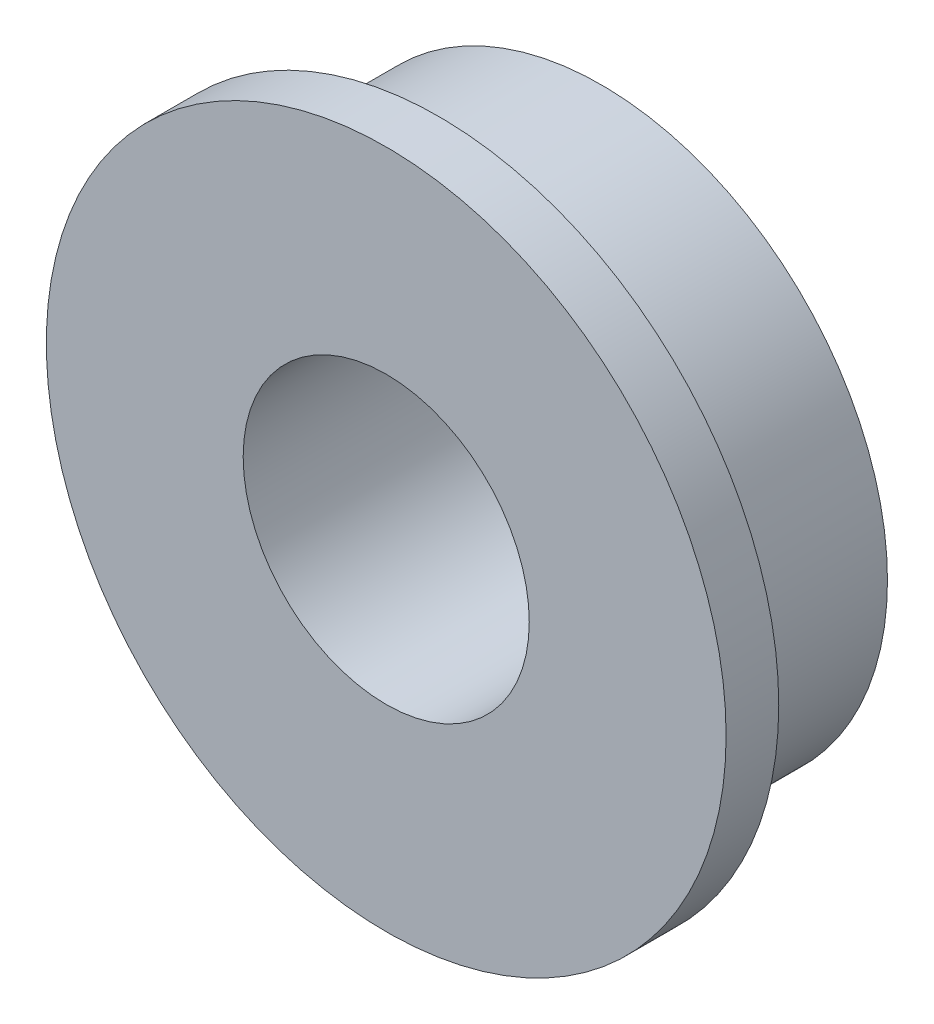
ISO-10303-21;
HEADER;
FILE_DESCRIPTION(('STEP AP214'),'2;1');
FILE_NAME('part.step','',(''),(''),'','','');
FILE_SCHEMA(('AUTOMOTIVE_DESIGN { 1 0 10303 214 1 1 1 1 }'));
ENDSEC;
DATA;
#1=APPLICATION_CONTEXT('core data for automotive mechanical design processes');
#2=APPLICATION_PROTOCOL_DEFINITION('international standard','automotive_design',2000,#1);
#3=PRODUCT_CONTEXT('',#1,'mechanical');
#4=PRODUCT('Part','Part','',(#3));
#5=PRODUCT_RELATED_PRODUCT_CATEGORY('part','',(#4));
#6=PRODUCT_DEFINITION_FORMATION('','',#4);
#7=PRODUCT_DEFINITION_CONTEXT('part definition',#1,'design');
#8=PRODUCT_DEFINITION('design','',#6,#7);
#9=PRODUCT_DEFINITION_SHAPE('','',#8);
#10=(LENGTH_UNIT() NAMED_UNIT(*) SI_UNIT(.MILLI.,.METRE.));
#11=(NAMED_UNIT(*) PLANE_ANGLE_UNIT() SI_UNIT($,.RADIAN.));
#12=(NAMED_UNIT(*) SI_UNIT($,.STERADIAN.) SOLID_ANGLE_UNIT());
#13=UNCERTAINTY_MEASURE_WITH_UNIT(LENGTH_MEASURE(1.E-05),#10,'distance_accuracy_value','');
#14=(GEOMETRIC_REPRESENTATION_CONTEXT(3) GLOBAL_UNCERTAINTY_ASSIGNED_CONTEXT((#13)) GLOBAL_UNIT_ASSIGNED_CONTEXT((#10,
#11,#12)) REPRESENTATION_CONTEXT('',''));
#15=CARTESIAN_POINT('',(0.,0.,0.));
#16=DIRECTION('',(0.,0.,1.));
#17=DIRECTION('',(1.,0.,0.));
#18=AXIS2_PLACEMENT_3D('',#15,#16,#17);
#19=CARTESIAN_POINT('',(0.,0.,2.3876));
#20=DIRECTION('',(0.,0.,-1.));
#21=DIRECTION('',(-1.,0.,0.));
#22=AXIS2_PLACEMENT_3D('',#19,#20,#21);
#23=CYLINDRICAL_SURFACE('',#22,3.175);
#24=CARTESIAN_POINT('',(0.,0.,0.));
#25=DIRECTION('',(0.,0.,1.));
#26=DIRECTION('',(1.,0.,0.));
#27=AXIS2_PLACEMENT_3D('',#24,#25,#26);
#28=CIRCLE('',#27,3.175);
#29=CARTESIAN_POINT('',(3.175,0.,0.));
#30=VERTEX_POINT('',#29);
#31=EDGE_CURVE('E34',#30,#30,#28,.T.);
#32=ORIENTED_EDGE('',*,*,#31,.T.);
#33=EDGE_LOOP('',(#32));
#34=FACE_BOUND('',#33,.T.);
#35=CARTESIAN_POINT('',(0.,0.,1.8034));
#36=DIRECTION('',(0.,0.,1.));
#37=DIRECTION('',(1.,0.,0.));
#38=AXIS2_PLACEMENT_3D('',#35,#36,#37);
#39=CIRCLE('',#38,3.175);
#40=CARTESIAN_POINT('',(3.175,0.,1.8034));
#41=VERTEX_POINT('',#40);
#42=EDGE_CURVE('E10',#41,#41,#39,.T.);
#43=ORIENTED_EDGE('',*,*,#42,.F.);
#44=EDGE_LOOP('',(#43));
#45=FACE_BOUND('',#44,.T.);
#46=ADVANCED_FACE('F28',(#34,#45),#23,.T.);
#47=CARTESIAN_POINT('',(0.,0.,2.3876));
#48=DIRECTION('',(0.,0.,1.));
#49=DIRECTION('',(1.,0.,0.));
#50=AXIS2_PLACEMENT_3D('',#47,#48,#49);
#51=PLANE('',#50);
#52=CARTESIAN_POINT('',(0.,0.,2.3876));
#53=DIRECTION('',(0.,0.,1.));
#54=DIRECTION('',(1.,0.,0.));
#55=AXIS2_PLACEMENT_3D('',#52,#53,#54);
#56=CIRCLE('',#55,1.5875);
#57=CARTESIAN_POINT('',(1.5875,0.,2.3876));
#58=VERTEX_POINT('',#57);
#59=EDGE_CURVE('E38',#58,#58,#56,.T.);
#60=ORIENTED_EDGE('',*,*,#59,.F.);
#61=EDGE_LOOP('',(#60));
#62=FACE_BOUND('',#61,.T.);
#63=CARTESIAN_POINT('',(0.,0.,2.3876));
#64=DIRECTION('',(0.,0.,1.));
#65=DIRECTION('',(1.,0.,0.));
#66=AXIS2_PLACEMENT_3D('',#63,#64,#65);
#67=CIRCLE('',#66,3.7719);
#68=CARTESIAN_POINT('',(3.7719,0.,2.3876));
#69=VERTEX_POINT('',#68);
#70=EDGE_CURVE('E50',#69,#69,#67,.T.);
#71=ORIENTED_EDGE('',*,*,#70,.T.);
#72=EDGE_LOOP('',(#71));
#73=FACE_BOUND('',#72,.T.);
#74=ADVANCED_FACE('F54',(#62,#73),#51,.T.);
#75=CARTESIAN_POINT('',(0.,0.,0.));
#76=DIRECTION('',(0.,0.,1.));
#77=DIRECTION('',(1.,0.,0.));
#78=AXIS2_PLACEMENT_3D('',#75,#76,#77);
#79=PLANE('',#78);
#80=ORIENTED_EDGE('',*,*,#31,.F.);
#81=EDGE_LOOP('',(#80));
#82=FACE_BOUND('',#81,.T.);
#83=CARTESIAN_POINT('',(0.,0.,0.));
#84=DIRECTION('',(0.,0.,1.));
#85=DIRECTION('',(1.,0.,0.));
#86=AXIS2_PLACEMENT_3D('',#83,#84,#85);
#87=CIRCLE('',#86,1.5875);
#88=CARTESIAN_POINT('',(1.5875,0.,0.));
#89=VERTEX_POINT('',#88);
#90=EDGE_CURVE('E42',#89,#89,#87,.T.);
#91=ORIENTED_EDGE('',*,*,#90,.T.);
#92=EDGE_LOOP('',(#91));
#93=FACE_BOUND('',#92,.T.);
#94=ADVANCED_FACE('F67',(#82,#93),#79,.F.);
#95=CARTESIAN_POINT('',(0.,0.,2.3876));
#96=DIRECTION('',(0.,0.,-1.));
#97=DIRECTION('',(-1.,0.,0.));
#98=AXIS2_PLACEMENT_3D('',#95,#96,#97);
#99=CYLINDRICAL_SURFACE('',#98,1.5875);
#100=ORIENTED_EDGE('',*,*,#59,.T.);
#101=EDGE_LOOP('',(#100));
#102=FACE_BOUND('',#101,.T.);
#103=ORIENTED_EDGE('',*,*,#90,.F.);
#104=EDGE_LOOP('',(#103));
#105=FACE_BOUND('',#104,.T.);
#106=ADVANCED_FACE('F59',(#102,#105),#99,.F.);
#107=CARTESIAN_POINT('',(0.,0.,1.8034));
#108=DIRECTION('',(0.,0.,1.));
#109=DIRECTION('',(1.,0.,0.));
#110=AXIS2_PLACEMENT_3D('',#107,#108,#109);
#111=CYLINDRICAL_SURFACE('',#110,3.7719);
#112=CARTESIAN_POINT('',(0.,0.,1.8034));
#113=DIRECTION('',(0.,0.,1.));
#114=DIRECTION('',(1.,0.,0.));
#115=AXIS2_PLACEMENT_3D('',#112,#113,#114);
#116=CIRCLE('',#115,3.7719);
#117=CARTESIAN_POINT('',(3.7719,0.,1.8034));
#118=VERTEX_POINT('',#117);
#119=EDGE_CURVE('E47',#118,#118,#116,.T.);
#120=ORIENTED_EDGE('',*,*,#119,.T.);
#121=EDGE_LOOP('',(#120));
#122=FACE_BOUND('',#121,.T.);
#123=ORIENTED_EDGE('',*,*,#70,.F.);
#124=EDGE_LOOP('',(#123));
#125=FACE_BOUND('',#124,.T.);
#126=ADVANCED_FACE('F56',(#122,#125),#111,.T.);
#127=CARTESIAN_POINT('',(0.,0.,1.8034));
#128=DIRECTION('',(0.,0.,1.));
#129=DIRECTION('',(1.,0.,0.));
#130=AXIS2_PLACEMENT_3D('',#127,#128,#129);
#131=PLANE('',#130);
#132=ORIENTED_EDGE('',*,*,#42,.T.);
#133=EDGE_LOOP('',(#132));
#134=FACE_BOUND('',#133,.T.);
#135=ORIENTED_EDGE('',*,*,#119,.F.);
#136=EDGE_LOOP('',(#135));
#137=FACE_BOUND('',#136,.T.);
#138=ADVANCED_FACE('F58',(#134,#137),#131,.F.);
#139=CLOSED_SHELL('',(#46,#74,#94,#106,#126,#138));
#140=MANIFOLD_SOLID_BREP('B2',#139);
#141=ADVANCED_BREP_SHAPE_REPRESENTATION('',(#18,#140),#14);
#142=SHAPE_DEFINITION_REPRESENTATION(#9,#141);
ENDSEC;
END-ISO-10303-21;
